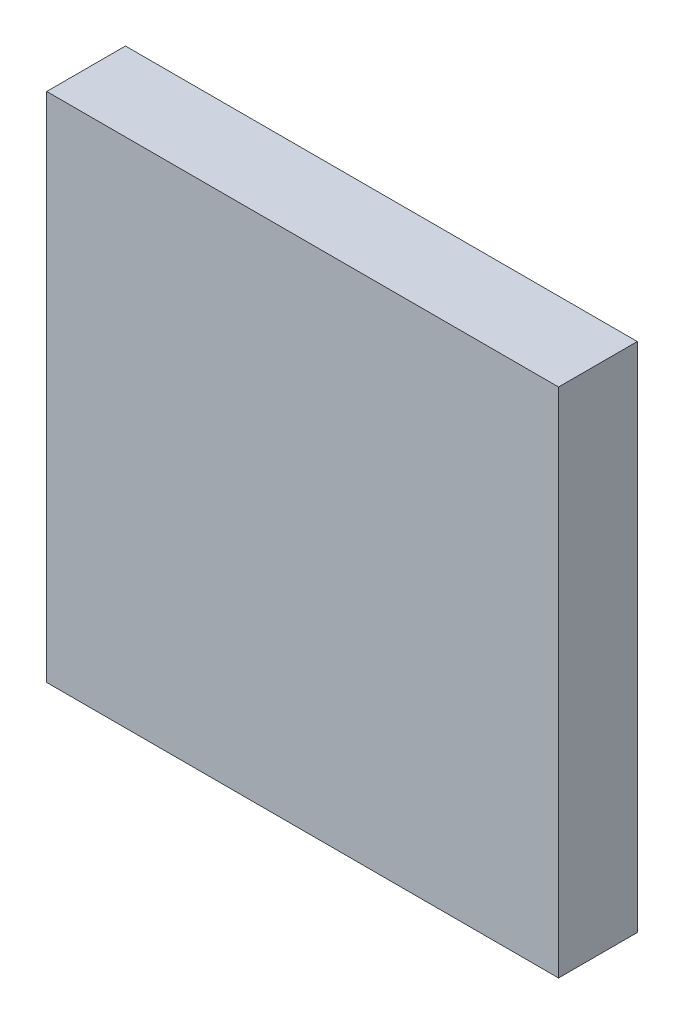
ISO-10303-21;
HEADER;
FILE_DESCRIPTION(('STEP AP214'),'2;1');
FILE_NAME('part.step','',(''),(''),'','','');
FILE_SCHEMA(('AUTOMOTIVE_DESIGN { 1 0 10303 214 1 1 1 1 }'));
ENDSEC;
DATA;
#1=APPLICATION_CONTEXT('core data for automotive mechanical design processes');
#2=APPLICATION_PROTOCOL_DEFINITION('international standard','automotive_design',2000,#1);
#3=PRODUCT_CONTEXT('',#1,'mechanical');
#4=PRODUCT('Part','Part','',(#3));
#5=PRODUCT_RELATED_PRODUCT_CATEGORY('part','',(#4));
#6=PRODUCT_DEFINITION_FORMATION('','',#4);
#7=PRODUCT_DEFINITION_CONTEXT('part definition',#1,'design');
#8=PRODUCT_DEFINITION('design','',#6,#7);
#9=PRODUCT_DEFINITION_SHAPE('','',#8);
#10=(LENGTH_UNIT() NAMED_UNIT(*) SI_UNIT(.MILLI.,.METRE.));
#11=(NAMED_UNIT(*) PLANE_ANGLE_UNIT() SI_UNIT($,.RADIAN.));
#12=(NAMED_UNIT(*) SI_UNIT($,.STERADIAN.) SOLID_ANGLE_UNIT());
#13=UNCERTAINTY_MEASURE_WITH_UNIT(LENGTH_MEASURE(1.E-05),#10,'distance_accuracy_value','');
#14=(GEOMETRIC_REPRESENTATION_CONTEXT(3) GLOBAL_UNCERTAINTY_ASSIGNED_CONTEXT((#13)) GLOBAL_UNIT_ASSIGNED_CONTEXT((#10,
#11,#12)) REPRESENTATION_CONTEXT('',''));
#15=CARTESIAN_POINT('',(0.,0.,0.));
#16=DIRECTION('',(0.,0.,1.));
#17=DIRECTION('',(1.,0.,0.));
#18=AXIS2_PLACEMENT_3D('',#15,#16,#17);
#19=CARTESIAN_POINT('',(-6.5,6.5,2.));
#20=DIRECTION('',(1.,0.,0.));
#21=DIRECTION('',(0.,1.,0.));
#22=AXIS2_PLACEMENT_3D('',#19,#20,#21);
#23=PLANE('',#22);
#24=DIRECTION('',(0.,-1.,0.));
#25=VECTOR('',#24,1.);
#26=CARTESIAN_POINT('',(-6.5,6.5,0.));
#27=LINE('',#26,#25);
#28=CARTESIAN_POINT('',(-6.5,6.5,0.));
#29=VERTEX_POINT('',#28);
#30=CARTESIAN_POINT('',(-6.5,-6.5,0.));
#31=VERTEX_POINT('',#30);
#32=EDGE_CURVE('E76',#29,#31,#27,.T.);
#33=ORIENTED_EDGE('',*,*,#32,.T.);
#34=DIRECTION('',(0.,0.,-1.));
#35=VECTOR('',#34,1.);
#36=CARTESIAN_POINT('',(-6.5,-6.5,2.));
#37=LINE('',#36,#35);
#38=CARTESIAN_POINT('',(-6.5,-6.5,2.));
#39=VERTEX_POINT('',#38);
#40=EDGE_CURVE('E11',#39,#31,#37,.T.);
#41=ORIENTED_EDGE('',*,*,#40,.F.);
#42=DIRECTION('',(0.,-1.,0.));
#43=VECTOR('',#42,1.);
#44=CARTESIAN_POINT('',(-6.5,6.5,2.));
#45=LINE('',#44,#43);
#46=CARTESIAN_POINT('',(-6.5,6.5,2.));
#47=VERTEX_POINT('',#46);
#48=EDGE_CURVE('E94',#47,#39,#45,.T.);
#49=ORIENTED_EDGE('',*,*,#48,.F.);
#50=DIRECTION('',(0.,0.,-1.));
#51=VECTOR('',#50,1.);
#52=CARTESIAN_POINT('',(-6.5,6.5,2.));
#53=LINE('',#52,#51);
#54=EDGE_CURVE('E88',#47,#29,#53,.T.);
#55=ORIENTED_EDGE('',*,*,#54,.T.);
#56=EDGE_LOOP('',(#33,#41,#49,#55));
#57=FACE_BOUND('',#56,.T.);
#58=ADVANCED_FACE('F32',(#57),#23,.F.);
#59=CARTESIAN_POINT('',(-6.5,-6.5,2.));
#60=DIRECTION('',(0.,1.,0.));
#61=DIRECTION('',(0.,0.,1.));
#62=AXIS2_PLACEMENT_3D('',#59,#60,#61);
#63=PLANE('',#62);
#64=DIRECTION('',(1.,0.,0.));
#65=VECTOR('',#64,1.);
#66=CARTESIAN_POINT('',(-6.5,-6.5,0.));
#67=LINE('',#66,#65);
#68=CARTESIAN_POINT('',(6.5,-6.5,0.));
#69=VERTEX_POINT('',#68);
#70=EDGE_CURVE('E72',#31,#69,#67,.T.);
#71=ORIENTED_EDGE('',*,*,#70,.T.);
#72=DIRECTION('',(0.,0.,-1.));
#73=VECTOR('',#72,1.);
#74=CARTESIAN_POINT('',(6.5,-6.5,2.));
#75=LINE('',#74,#73);
#76=CARTESIAN_POINT('',(6.5,-6.5,2.));
#77=VERTEX_POINT('',#76);
#78=EDGE_CURVE('E39',#77,#69,#75,.T.);
#79=ORIENTED_EDGE('',*,*,#78,.F.);
#80=DIRECTION('',(1.,0.,0.));
#81=VECTOR('',#80,1.);
#82=CARTESIAN_POINT('',(-6.5,-6.5,2.));
#83=LINE('',#82,#81);
#84=EDGE_CURVE('E84',#39,#77,#83,.T.);
#85=ORIENTED_EDGE('',*,*,#84,.F.);
#86=ORIENTED_EDGE('',*,*,#40,.T.);
#87=EDGE_LOOP('',(#71,#79,#85,#86));
#88=FACE_BOUND('',#87,.T.);
#89=ADVANCED_FACE('F83',(#88),#63,.F.);
#90=CARTESIAN_POINT('',(6.5,6.5,2.));
#91=DIRECTION('',(-1.,0.,0.));
#92=DIRECTION('',(0.,-1.,0.));
#93=AXIS2_PLACEMENT_3D('',#90,#91,#92);
#94=PLANE('',#93);
#95=DIRECTION('',(0.,1.,0.));
#96=VECTOR('',#95,1.);
#97=CARTESIAN_POINT('',(6.5,6.5,0.));
#98=LINE('',#97,#96);
#99=CARTESIAN_POINT('',(6.5,6.5,0.));
#100=VERTEX_POINT('',#99);
#101=EDGE_CURVE('E77',#69,#100,#98,.T.);
#102=ORIENTED_EDGE('',*,*,#101,.T.);
#103=DIRECTION('',(0.,0.,-1.));
#104=VECTOR('',#103,1.);
#105=CARTESIAN_POINT('',(6.5,6.5,2.));
#106=LINE('',#105,#104);
#107=CARTESIAN_POINT('',(6.5,6.5,2.));
#108=VERTEX_POINT('',#107);
#109=EDGE_CURVE('E100',#108,#100,#106,.T.);
#110=ORIENTED_EDGE('',*,*,#109,.F.);
#111=DIRECTION('',(0.,1.,0.));
#112=VECTOR('',#111,1.);
#113=CARTESIAN_POINT('',(6.5,6.5,2.));
#114=LINE('',#113,#112);
#115=EDGE_CURVE('E51',#77,#108,#114,.T.);
#116=ORIENTED_EDGE('',*,*,#115,.F.);
#117=ORIENTED_EDGE('',*,*,#78,.T.);
#118=EDGE_LOOP('',(#102,#110,#116,#117));
#119=FACE_BOUND('',#118,.T.);
#120=ADVANCED_FACE('F103',(#119),#94,.F.);
#121=CARTESIAN_POINT('',(-6.5,6.5,2.));
#122=DIRECTION('',(0.,-1.,0.));
#123=DIRECTION('',(1.,0.,0.));
#124=AXIS2_PLACEMENT_3D('',#121,#122,#123);
#125=PLANE('',#124);
#126=DIRECTION('',(-1.,0.,0.));
#127=VECTOR('',#126,1.);
#128=CARTESIAN_POINT('',(-6.5,6.5,0.));
#129=LINE('',#128,#127);
#130=EDGE_CURVE('E92',#100,#29,#129,.T.);
#131=ORIENTED_EDGE('',*,*,#130,.T.);
#132=ORIENTED_EDGE('',*,*,#54,.F.);
#133=DIRECTION('',(-1.,0.,0.));
#134=VECTOR('',#133,1.);
#135=CARTESIAN_POINT('',(-6.5,6.5,2.));
#136=LINE('',#135,#134);
#137=EDGE_CURVE('E46',#108,#47,#136,.T.);
#138=ORIENTED_EDGE('',*,*,#137,.F.);
#139=ORIENTED_EDGE('',*,*,#109,.T.);
#140=EDGE_LOOP('',(#131,#132,#138,#139));
#141=FACE_BOUND('',#140,.T.);
#142=ADVANCED_FACE('F105',(#141),#125,.F.);
#143=CARTESIAN_POINT('',(-6.5,6.5,2.));
#144=DIRECTION('',(0.,0.,1.));
#145=DIRECTION('',(1.,0.,0.));
#146=AXIS2_PLACEMENT_3D('',#143,#144,#145);
#147=PLANE('',#146);
#148=ORIENTED_EDGE('',*,*,#48,.T.);
#149=ORIENTED_EDGE('',*,*,#84,.T.);
#150=ORIENTED_EDGE('',*,*,#115,.T.);
#151=ORIENTED_EDGE('',*,*,#137,.T.);
#152=EDGE_LOOP('',(#148,#149,#150,#151));
#153=FACE_BOUND('',#152,.T.);
#154=ADVANCED_FACE('F106',(#153),#147,.T.);
#155=CARTESIAN_POINT('',(-6.5,6.5,0.));
#156=DIRECTION('',(0.,0.,1.));
#157=DIRECTION('',(1.,0.,0.));
#158=AXIS2_PLACEMENT_3D('',#155,#156,#157);
#159=PLANE('',#158);
#160=ORIENTED_EDGE('',*,*,#32,.F.);
#161=ORIENTED_EDGE('',*,*,#130,.F.);
#162=ORIENTED_EDGE('',*,*,#101,.F.);
#163=ORIENTED_EDGE('',*,*,#70,.F.);
#164=EDGE_LOOP('',(#160,#161,#162,#163));
#165=FACE_BOUND('',#164,.T.);
#166=ADVANCED_FACE('F73',(#165),#159,.F.);
#167=CLOSED_SHELL('',(#58,#89,#120,#142,#154,#166));
#168=MANIFOLD_SOLID_BREP('B2',#167);
#169=ADVANCED_BREP_SHAPE_REPRESENTATION('',(#18,#168),#14);
#170=SHAPE_DEFINITION_REPRESENTATION(#9,#169);
ENDSEC;
END-ISO-10303-21;
